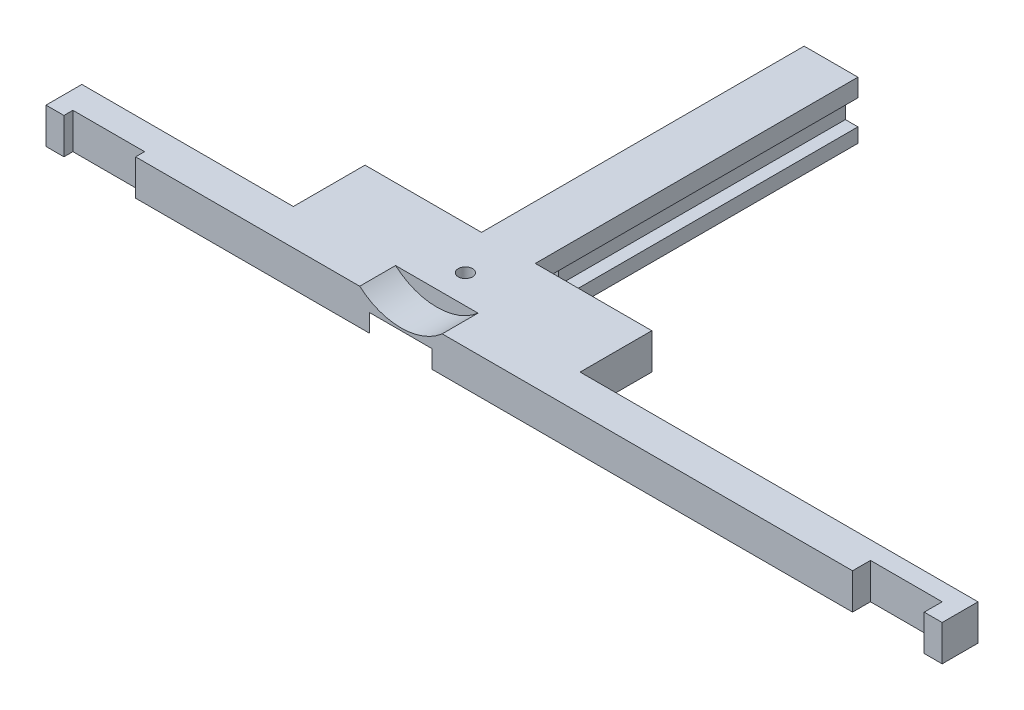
ISO-10303-21;
HEADER;
FILE_DESCRIPTION(('STEP AP214'),'2;1');
FILE_NAME('part.step','',(''),(''),'','','');
FILE_SCHEMA(('AUTOMOTIVE_DESIGN { 1 0 10303 214 1 1 1 1 }'));
ENDSEC;
DATA;
#1=APPLICATION_CONTEXT('core data for automotive mechanical design processes');
#2=APPLICATION_PROTOCOL_DEFINITION('international standard','automotive_design',2000,#1);
#3=PRODUCT_CONTEXT('',#1,'mechanical');
#4=PRODUCT('Part','Part','',(#3));
#5=PRODUCT_RELATED_PRODUCT_CATEGORY('part','',(#4));
#6=PRODUCT_DEFINITION_FORMATION('','',#4);
#7=PRODUCT_DEFINITION_CONTEXT('part definition',#1,'design');
#8=PRODUCT_DEFINITION('design','',#6,#7);
#9=PRODUCT_DEFINITION_SHAPE('','',#8);
#10=(LENGTH_UNIT() NAMED_UNIT(*) SI_UNIT(.MILLI.,.METRE.));
#11=(NAMED_UNIT(*) PLANE_ANGLE_UNIT() SI_UNIT($,.RADIAN.));
#12=(NAMED_UNIT(*) SI_UNIT($,.STERADIAN.) SOLID_ANGLE_UNIT());
#13=UNCERTAINTY_MEASURE_WITH_UNIT(LENGTH_MEASURE(1.E-05),#10,'distance_accuracy_value','');
#14=(GEOMETRIC_REPRESENTATION_CONTEXT(3) GLOBAL_UNCERTAINTY_ASSIGNED_CONTEXT((#13)) GLOBAL_UNIT_ASSIGNED_CONTEXT((#10,
#11,#12)) REPRESENTATION_CONTEXT('',''));
#15=CARTESIAN_POINT('',(0.,0.,0.));
#16=DIRECTION('',(0.,0.,1.));
#17=DIRECTION('',(1.,0.,0.));
#18=AXIS2_PLACEMENT_3D('',#15,#16,#17);
#19=CARTESIAN_POINT('',(-99.,10.,-30.));
#20=DIRECTION('',(0.,0.,1.));
#21=DIRECTION('',(1.,0.,0.));
#22=AXIS2_PLACEMENT_3D('',#19,#20,#21);
#23=PLANE('',#22);
#24=DIRECTION('',(0.,1.,0.));
#25=VECTOR('',#24,1.);
#26=CARTESIAN_POINT('',(-7.49999999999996,10.,-30.));
#27=LINE('',#26,#25);
#28=CARTESIAN_POINT('',(-7.49999999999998,5.,-30.));
#29=VERTEX_POINT('',#28);
#30=CARTESIAN_POINT('',(-7.49999999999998,10.,-30.));
#31=VERTEX_POINT('',#30);
#32=EDGE_CURVE('E341',#29,#31,#27,.T.);
#33=ORIENTED_EDGE('',*,*,#32,.F.);
#34=DIRECTION('',(-1.,0.,0.));
#35=VECTOR('',#34,1.);
#36=CARTESIAN_POINT('',(-99.,5.,-30.));
#37=LINE('',#36,#35);
#38=CARTESIAN_POINT('',(-16.,5.,-30.));
#39=VERTEX_POINT('',#38);
#40=EDGE_CURVE('E425',#29,#39,#37,.T.);
#41=ORIENTED_EDGE('',*,*,#40,.T.);
#42=DIRECTION('',(0.,-1.,0.));
#43=VECTOR('',#42,1.);
#44=CARTESIAN_POINT('',(-16.,5.,-30.));
#45=LINE('',#44,#43);
#46=CARTESIAN_POINT('',(-16.,0.,-30.));
#47=VERTEX_POINT('',#46);
#48=EDGE_CURVE('E422',#47,#39,#45,.F.);
#49=ORIENTED_EDGE('',*,*,#48,.F.);
#50=DIRECTION('',(-1.,0.,0.));
#51=VECTOR('',#50,1.);
#52=CARTESIAN_POINT('',(-99.,0.,-30.));
#53=LINE('',#52,#51);
#54=CARTESIAN_POINT('',(-40.,0.,-30.));
#55=VERTEX_POINT('',#54);
#56=EDGE_CURVE('E464',#47,#55,#53,.T.);
#57=ORIENTED_EDGE('',*,*,#56,.T.);
#58=DIRECTION('',(0.,1.,0.));
#59=VECTOR('',#58,1.);
#60=CARTESIAN_POINT('',(-40.,0.,-30.));
#61=LINE('',#60,#59);
#62=CARTESIAN_POINT('',(-40.,10.,-30.));
#63=VERTEX_POINT('',#62);
#64=EDGE_CURVE('E404',#55,#63,#61,.T.);
#65=ORIENTED_EDGE('',*,*,#64,.T.);
#66=DIRECTION('',(-1.,0.,0.));
#67=VECTOR('',#66,1.);
#68=CARTESIAN_POINT('',(-99.,10.,-30.));
#69=LINE('',#68,#67);
#70=EDGE_CURVE('E436',#31,#63,#69,.T.);
#71=ORIENTED_EDGE('',*,*,#70,.F.);
#72=EDGE_LOOP('',(#33,#41,#49,#57,#65,#71));
#73=FACE_BOUND('',#72,.T.);
#74=ADVANCED_FACE('F37',(#73),#23,.F.);
#75=DIRECTION('',(0.,-1.,0.));
#76=VECTOR('',#75,1.);
#77=CARTESIAN_POINT('',(7.5,10.,-30.));
#78=LINE('',#77,#76);
#79=CARTESIAN_POINT('',(7.50000000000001,10.,-30.));
#80=VERTEX_POINT('',#79);
#81=CARTESIAN_POINT('',(7.5,5.,-30.));
#82=VERTEX_POINT('',#81);
#83=EDGE_CURVE('E344',#80,#82,#78,.T.);
#84=ORIENTED_EDGE('',*,*,#83,.F.);
#85=CARTESIAN_POINT('',(40.,10.,-30.));
#86=VERTEX_POINT('',#85);
#87=EDGE_CURVE('E437',#86,#80,#69,.T.);
#88=ORIENTED_EDGE('',*,*,#87,.F.);
#89=DIRECTION('',(0.,1.,0.));
#90=VECTOR('',#89,1.);
#91=CARTESIAN_POINT('',(40.,0.,-30.));
#92=LINE('',#91,#90);
#93=CARTESIAN_POINT('',(40.,0.,-30.));
#94=VERTEX_POINT('',#93);
#95=EDGE_CURVE('E385',#94,#86,#92,.T.);
#96=ORIENTED_EDGE('',*,*,#95,.F.);
#97=CARTESIAN_POINT('',(16.,0.,-30.));
#98=VERTEX_POINT('',#97);
#99=EDGE_CURVE('E465',#94,#98,#53,.T.);
#100=ORIENTED_EDGE('',*,*,#99,.T.);
#101=DIRECTION('',(0.,-1.,0.));
#102=VECTOR('',#101,1.);
#103=CARTESIAN_POINT('',(16.,5.,-30.));
#104=LINE('',#103,#102);
#105=CARTESIAN_POINT('',(16.,5.,-30.));
#106=VERTEX_POINT('',#105);
#107=EDGE_CURVE('E419',#106,#98,#104,.T.);
#108=ORIENTED_EDGE('',*,*,#107,.F.);
#109=EDGE_CURVE('E426',#106,#82,#37,.T.);
#110=ORIENTED_EDGE('',*,*,#109,.T.);
#111=EDGE_LOOP('',(#84,#88,#96,#100,#108,#110));
#112=FACE_BOUND('',#111,.T.);
#113=ADVANCED_FACE('F582',(#112),#23,.F.);
#114=CARTESIAN_POINT('',(151.,10.,-30.));
#115=DIRECTION('',(-1.,0.,0.));
#116=DIRECTION('',(0.,0.,1.));
#117=AXIS2_PLACEMENT_3D('',#114,#115,#116);
#118=PLANE('',#117);
#119=DIRECTION('',(0.,1.,0.));
#120=VECTOR('',#119,1.);
#121=CARTESIAN_POINT('',(151.,0.,-9.99999999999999));
#122=LINE('',#121,#120);
#123=CARTESIAN_POINT('',(151.,0.,-10.));
#124=VERTEX_POINT('',#123);
#125=CARTESIAN_POINT('',(151.,10.,-9.99999999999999));
#126=VERTEX_POINT('',#125);
#127=EDGE_CURVE('E388',#124,#126,#122,.T.);
#128=ORIENTED_EDGE('',*,*,#127,.T.);
#129=DIRECTION('',(0.,0.,-1.));
#130=VECTOR('',#129,1.);
#131=CARTESIAN_POINT('',(151.,10.,-30.));
#132=LINE('',#131,#130);
#133=CARTESIAN_POINT('',(151.,10.,0.));
#134=VERTEX_POINT('',#133);
#135=EDGE_CURVE('E432',#134,#126,#132,.T.);
#136=ORIENTED_EDGE('',*,*,#135,.F.);
#137=DIRECTION('',(0.,-1.,0.));
#138=VECTOR('',#137,1.);
#139=CARTESIAN_POINT('',(151.,10.,0.));
#140=LINE('',#139,#138);
#141=CARTESIAN_POINT('',(151.,0.,0.));
#142=VERTEX_POINT('',#141);
#143=EDGE_CURVE('E512',#134,#142,#140,.T.);
#144=ORIENTED_EDGE('',*,*,#143,.T.);
#145=DIRECTION('',(0.,0.,-1.));
#146=VECTOR('',#145,1.);
#147=CARTESIAN_POINT('',(151.,0.,-30.));
#148=LINE('',#147,#146);
#149=EDGE_CURVE('E461',#142,#124,#148,.T.);
#150=ORIENTED_EDGE('',*,*,#149,.T.);
#151=EDGE_LOOP('',(#128,#136,#144,#150));
#152=FACE_BOUND('',#151,.T.);
#153=ADVANCED_FACE('F613',(#152),#118,.F.);
#154=CARTESIAN_POINT('',(0.,10.,0.));
#155=DIRECTION('',(0.,-1.,0.));
#156=DIRECTION('',(0.,0.,-1.));
#157=AXIS2_PLACEMENT_3D('',#154,#155,#156);
#158=PLANE('',#157);
#159=CARTESIAN_POINT('',(0.,10.,-18.));
#160=DIRECTION('',(0.,-1.,0.));
#161=DIRECTION('',(0.,0.,-1.));
#162=AXIS2_PLACEMENT_3D('',#159,#160,#161);
#163=CIRCLE('',#162,2.);
#164=CARTESIAN_POINT('',(0.,10.,-20.));
#165=VERTEX_POINT('',#164);
#166=EDGE_CURVE('E660',#165,#165,#163,.T.);
#167=ORIENTED_EDGE('',*,*,#166,.T.);
#168=EDGE_LOOP('',(#167));
#169=FACE_BOUND('',#168,.T.);
#170=DIRECTION('',(-1.,0.,0.));
#171=VECTOR('',#170,1.);
#172=CARTESIAN_POINT('',(0.,10.,-10.));
#173=LINE('',#172,#171);
#174=CARTESIAN_POINT('',(11.522818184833,10.,-10.));
#175=VERTEX_POINT('',#174);
#176=CARTESIAN_POINT('',(-11.4843424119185,10.,-10.));
#177=VERTEX_POINT('',#176);
#178=EDGE_CURVE('E11',#175,#177,#173,.T.);
#179=ORIENTED_EDGE('',*,*,#178,.F.);
#180=DIRECTION('',(0.,0.,1.));
#181=VECTOR('',#180,1.);
#182=CARTESIAN_POINT('',(11.522818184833,10.,-10.));
#183=LINE('',#182,#181);
#184=CARTESIAN_POINT('',(11.522818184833,10.,0.));
#185=VERTEX_POINT('',#184);
#186=EDGE_CURVE('E264',#175,#185,#183,.T.);
#187=ORIENTED_EDGE('',*,*,#186,.T.);
#188=DIRECTION('',(1.,0.,0.));
#189=VECTOR('',#188,1.);
#190=CARTESIAN_POINT('',(-74.,10.,0.));
#191=LINE('',#190,#189);
#192=CARTESIAN_POINT('',(126.,10.,0.));
#193=VERTEX_POINT('',#192);
#194=EDGE_CURVE('E450',#185,#193,#191,.T.);
#195=ORIENTED_EDGE('',*,*,#194,.T.);
#196=DIRECTION('',(0.,0.,-1.));
#197=VECTOR('',#196,1.);
#198=CARTESIAN_POINT('',(126.,10.,-5.));
#199=LINE('',#198,#197);
#200=CARTESIAN_POINT('',(126.,10.,-5.));
#201=VERTEX_POINT('',#200);
#202=EDGE_CURVE('E452',#193,#201,#199,.T.);
#203=ORIENTED_EDGE('',*,*,#202,.T.);
#204=DIRECTION('',(1.,0.,0.));
#205=VECTOR('',#204,1.);
#206=CARTESIAN_POINT('',(146.,10.,-5.));
#207=LINE('',#206,#205);
#208=CARTESIAN_POINT('',(146.,10.,-5.));
#209=VERTEX_POINT('',#208);
#210=EDGE_CURVE('E454',#201,#209,#207,.T.);
#211=ORIENTED_EDGE('',*,*,#210,.T.);
#212=DIRECTION('',(0.,0.,1.));
#213=VECTOR('',#212,1.);
#214=CARTESIAN_POINT('',(146.,10.,0.));
#215=LINE('',#214,#213);
#216=CARTESIAN_POINT('',(146.,10.,0.));
#217=VERTEX_POINT('',#216);
#218=EDGE_CURVE('E456',#209,#217,#215,.T.);
#219=ORIENTED_EDGE('',*,*,#218,.T.);
#220=DIRECTION('',(1.,0.,0.));
#221=VECTOR('',#220,1.);
#222=CARTESIAN_POINT('',(146.,10.,0.));
#223=LINE('',#222,#221);
#224=EDGE_CURVE('E429',#217,#134,#223,.T.);
#225=ORIENTED_EDGE('',*,*,#224,.T.);
#226=ORIENTED_EDGE('',*,*,#135,.T.);
#227=DIRECTION('',(-1.,0.,0.));
#228=VECTOR('',#227,1.);
#229=CARTESIAN_POINT('',(0.,10.,-9.99999999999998));
#230=LINE('',#229,#228);
#231=CARTESIAN_POINT('',(40.,10.,-9.99999999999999));
#232=VERTEX_POINT('',#231);
#233=EDGE_CURVE('E376',#126,#232,#230,.T.);
#234=ORIENTED_EDGE('',*,*,#233,.T.);
#235=DIRECTION('',(0.,0.,-1.));
#236=VECTOR('',#235,1.);
#237=CARTESIAN_POINT('',(40.,10.,0.));
#238=LINE('',#237,#236);
#239=EDGE_CURVE('E379',#232,#86,#238,.T.);
#240=ORIENTED_EDGE('',*,*,#239,.T.);
#241=ORIENTED_EDGE('',*,*,#87,.T.);
#242=DIRECTION('',(0.,0.,1.));
#243=VECTOR('',#242,1.);
#244=CARTESIAN_POINT('',(7.5,10.,-40.));
#245=LINE('',#244,#243);
#246=CARTESIAN_POINT('',(7.5,10.,-120.));
#247=VERTEX_POINT('',#246);
#248=EDGE_CURVE('E354',#247,#80,#245,.T.);
#249=ORIENTED_EDGE('',*,*,#248,.F.);
#250=DIRECTION('',(1.,0.,0.));
#251=VECTOR('',#250,1.);
#252=CARTESIAN_POINT('',(7.5,10.,-120.));
#253=LINE('',#252,#251);
#254=CARTESIAN_POINT('',(-7.49999999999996,10.,-120.));
#255=VERTEX_POINT('',#254);
#256=EDGE_CURVE('E302',#255,#247,#253,.T.);
#257=ORIENTED_EDGE('',*,*,#256,.F.);
#258=DIRECTION('',(0.,0.,1.));
#259=VECTOR('',#258,1.);
#260=CARTESIAN_POINT('',(-7.49999999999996,10.,-40.));
#261=LINE('',#260,#259);
#262=EDGE_CURVE('E357',#255,#31,#261,.T.);
#263=ORIENTED_EDGE('',*,*,#262,.T.);
#264=ORIENTED_EDGE('',*,*,#70,.T.);
#265=DIRECTION('',(0.,0.,-1.));
#266=VECTOR('',#265,1.);
#267=CARTESIAN_POINT('',(-40.,10.,0.));
#268=LINE('',#267,#266);
#269=CARTESIAN_POINT('',(-40.,10.,-10.));
#270=VERTEX_POINT('',#269);
#271=EDGE_CURVE('E396',#270,#63,#268,.T.);
#272=ORIENTED_EDGE('',*,*,#271,.F.);
#273=DIRECTION('',(1.,0.,0.));
#274=VECTOR('',#273,1.);
#275=CARTESIAN_POINT('',(0.,10.,-10.));
#276=LINE('',#275,#274);
#277=CARTESIAN_POINT('',(-99.,10.,-10.));
#278=VERTEX_POINT('',#277);
#279=EDGE_CURVE('E370',#278,#270,#276,.T.);
#280=ORIENTED_EDGE('',*,*,#279,.F.);
#281=DIRECTION('',(0.,0.,1.));
#282=VECTOR('',#281,1.);
#283=CARTESIAN_POINT('',(-99.,10.,-30.));
#284=LINE('',#283,#282);
#285=CARTESIAN_POINT('',(-99.,10.,0.));
#286=VERTEX_POINT('',#285);
#287=EDGE_CURVE('E440',#278,#286,#284,.T.);
#288=ORIENTED_EDGE('',*,*,#287,.T.);
#289=DIRECTION('',(1.,0.,0.));
#290=VECTOR('',#289,1.);
#291=CARTESIAN_POINT('',(-99.,10.,0.));
#292=LINE('',#291,#290);
#293=CARTESIAN_POINT('',(-94.,10.,0.));
#294=VERTEX_POINT('',#293);
#295=EDGE_CURVE('E442',#286,#294,#292,.T.);
#296=ORIENTED_EDGE('',*,*,#295,.T.);
#297=DIRECTION('',(0.,0.,-1.));
#298=VECTOR('',#297,1.);
#299=CARTESIAN_POINT('',(-94.,10.,-2.49999999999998));
#300=LINE('',#299,#298);
#301=CARTESIAN_POINT('',(-94.,10.,-2.49999999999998));
#302=VERTEX_POINT('',#301);
#303=EDGE_CURVE('E444',#294,#302,#300,.T.);
#304=ORIENTED_EDGE('',*,*,#303,.T.);
#305=DIRECTION('',(1.,0.,0.));
#306=VECTOR('',#305,1.);
#307=CARTESIAN_POINT('',(-74.,10.,-2.49999999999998));
#308=LINE('',#307,#306);
#309=CARTESIAN_POINT('',(-74.,10.,-2.49999999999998));
#310=VERTEX_POINT('',#309);
#311=EDGE_CURVE('E446',#302,#310,#308,.T.);
#312=ORIENTED_EDGE('',*,*,#311,.T.);
#313=DIRECTION('',(0.,0.,1.));
#314=VECTOR('',#313,1.);
#315=CARTESIAN_POINT('',(-74.,10.,-2.49999999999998));
#316=LINE('',#315,#314);
#317=CARTESIAN_POINT('',(-74.,10.,0.));
#318=VERTEX_POINT('',#317);
#319=EDGE_CURVE('E448',#310,#318,#316,.T.);
#320=ORIENTED_EDGE('',*,*,#319,.T.);
#321=CARTESIAN_POINT('',(-11.4843424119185,10.,0.));
#322=VERTEX_POINT('',#321);
#323=EDGE_CURVE('E270',#318,#322,#191,.T.);
#324=ORIENTED_EDGE('',*,*,#323,.T.);
#325=DIRECTION('',(0.,0.,1.));
#326=VECTOR('',#325,1.);
#327=CARTESIAN_POINT('',(-11.4843424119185,10.,-10.));
#328=LINE('',#327,#326);
#329=EDGE_CURVE('E52',#322,#177,#328,.F.);
#330=ORIENTED_EDGE('',*,*,#329,.T.);
#331=EDGE_LOOP('',(#179,#187,#195,#203,#211,#219,#225,#226,#234,#240,#241,#249,#257,#263,#264,
#272,#280,#288,#296,#304,#312,#320,#324,#330));
#332=FACE_BOUND('',#331,.T.);
#333=ADVANCED_FACE('F268',(#169,#332),#158,.F.);
#334=CARTESIAN_POINT('',(0.,0.,0.));
#335=DIRECTION('',(0.,-1.,0.));
#336=DIRECTION('',(0.,0.,-1.));
#337=AXIS2_PLACEMENT_3D('',#334,#335,#336);
#338=PLANE('',#337);
#339=CARTESIAN_POINT('',(30.,0.,-18.));
#340=DIRECTION('',(0.,-1.,0.));
#341=DIRECTION('',(0.,0.,1.));
#342=AXIS2_PLACEMENT_3D('',#339,#340,#341);
#343=CIRCLE('',#342,2.);
#344=CARTESIAN_POINT('',(30.,0.,-16.));
#345=VERTEX_POINT('',#344);
#346=EDGE_CURVE('E360',#345,#345,#343,.T.);
#347=ORIENTED_EDGE('',*,*,#346,.F.);
#348=EDGE_LOOP('',(#347));
#349=FACE_BOUND('',#348,.T.);
#350=ORIENTED_EDGE('',*,*,#99,.F.);
#351=DIRECTION('',(0.,0.,-1.));
#352=VECTOR('',#351,1.);
#353=CARTESIAN_POINT('',(40.,0.,0.));
#354=LINE('',#353,#352);
#355=CARTESIAN_POINT('',(40.,0.,-9.99999999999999));
#356=VERTEX_POINT('',#355);
#357=EDGE_CURVE('E373',#356,#94,#354,.T.);
#358=ORIENTED_EDGE('',*,*,#357,.F.);
#359=DIRECTION('',(-1.,0.,0.));
#360=VECTOR('',#359,1.);
#361=CARTESIAN_POINT('',(0.,0.,-9.99999999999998));
#362=LINE('',#361,#360);
#363=EDGE_CURVE('E375',#124,#356,#362,.T.);
#364=ORIENTED_EDGE('',*,*,#363,.F.);
#365=ORIENTED_EDGE('',*,*,#149,.F.);
#366=DIRECTION('',(1.,0.,0.));
#367=VECTOR('',#366,1.);
#368=CARTESIAN_POINT('',(146.,0.,0.));
#369=LINE('',#368,#367);
#370=CARTESIAN_POINT('',(146.,0.,0.));
#371=VERTEX_POINT('',#370);
#372=EDGE_CURVE('E428',#371,#142,#369,.T.);
#373=ORIENTED_EDGE('',*,*,#372,.F.);
#374=DIRECTION('',(0.,0.,1.));
#375=VECTOR('',#374,1.);
#376=CARTESIAN_POINT('',(146.,0.,0.));
#377=LINE('',#376,#375);
#378=CARTESIAN_POINT('',(146.,0.,-5.));
#379=VERTEX_POINT('',#378);
#380=EDGE_CURVE('E433',#379,#371,#377,.T.);
#381=ORIENTED_EDGE('',*,*,#380,.F.);
#382=DIRECTION('',(1.,0.,0.));
#383=VECTOR('',#382,1.);
#384=CARTESIAN_POINT('',(146.,0.,-5.));
#385=LINE('',#384,#383);
#386=CARTESIAN_POINT('',(126.,0.,-5.));
#387=VERTEX_POINT('',#386);
#388=EDGE_CURVE('E483',#387,#379,#385,.T.);
#389=ORIENTED_EDGE('',*,*,#388,.F.);
#390=DIRECTION('',(0.,0.,-1.));
#391=VECTOR('',#390,1.);
#392=CARTESIAN_POINT('',(126.,0.,-5.));
#393=LINE('',#392,#391);
#394=CARTESIAN_POINT('',(126.,0.,0.));
#395=VERTEX_POINT('',#394);
#396=EDGE_CURVE('E481',#395,#387,#393,.T.);
#397=ORIENTED_EDGE('',*,*,#396,.F.);
#398=DIRECTION('',(1.,0.,0.));
#399=VECTOR('',#398,1.);
#400=CARTESIAN_POINT('',(-74.,0.,0.));
#401=LINE('',#400,#399);
#402=CARTESIAN_POINT('',(8.71779788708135,0.,0.));
#403=VERTEX_POINT('',#402);
#404=EDGE_CURVE('E477',#403,#395,#401,.T.);
#405=ORIENTED_EDGE('',*,*,#404,.F.);
#406=CARTESIAN_POINT('',(0.,0.,-18.));
#407=DIRECTION('',(0.,1.,0.));
#408=DIRECTION('',(0.,0.,1.));
#409=AXIS2_PLACEMENT_3D('',#406,#407,#408);
#410=CIRCLE('',#409,20.);
#411=EDGE_CURVE('E387',#403,#98,#410,.T.);
#412=ORIENTED_EDGE('',*,*,#411,.T.);
#413=EDGE_LOOP('',(#350,#358,#364,#365,#373,#381,#389,#397,#405,#412));
#414=FACE_BOUND('',#413,.T.);
#415=ADVANCED_FACE('F592',(#349,#414),#338,.T.);
#416=CARTESIAN_POINT('',(-74.,10.,0.));
#417=DIRECTION('',(0.,0.,-1.));
#418=DIRECTION('',(-1.,0.,0.));
#419=AXIS2_PLACEMENT_3D('',#416,#417,#418);
#420=PLANE('',#419);
#421=ORIENTED_EDGE('',*,*,#194,.F.);
#422=CARTESIAN_POINT('',(0.019237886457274,23.1877837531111,0.));
#423=DIRECTION('',(0.,0.,1.));
#424=DIRECTION('',(1.,0.,0.));
#425=AXIS2_PLACEMENT_3D('',#422,#423,#424);
#426=CIRCLE('',#425,17.5);
#427=EDGE_CURVE('E265',#322,#185,#426,.T.);
#428=ORIENTED_EDGE('',*,*,#427,.F.);
#429=ORIENTED_EDGE('',*,*,#323,.F.);
#430=DIRECTION('',(0.,-1.,0.));
#431=VECTOR('',#430,1.);
#432=CARTESIAN_POINT('',(-74.,10.,0.));
#433=LINE('',#432,#431);
#434=CARTESIAN_POINT('',(-74.,0.,0.));
#435=VERTEX_POINT('',#434);
#436=EDGE_CURVE('E497',#318,#435,#433,.T.);
#437=ORIENTED_EDGE('',*,*,#436,.T.);
#438=CARTESIAN_POINT('',(-8.71779788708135,0.,0.));
#439=VERTEX_POINT('',#438);
#440=EDGE_CURVE('E478',#435,#439,#401,.T.);
#441=ORIENTED_EDGE('',*,*,#440,.T.);
#442=DIRECTION('',(0.,-1.,0.));
#443=VECTOR('',#442,1.);
#444=CARTESIAN_POINT('',(-8.71779788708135,5.,0.));
#445=LINE('',#444,#443);
#446=CARTESIAN_POINT('',(-8.71779788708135,5.,0.));
#447=VERTEX_POINT('',#446);
#448=EDGE_CURVE('E412',#447,#439,#445,.T.);
#449=ORIENTED_EDGE('',*,*,#448,.F.);
#450=DIRECTION('',(1.,0.,0.));
#451=VECTOR('',#450,1.);
#452=CARTESIAN_POINT('',(-74.,5.,0.));
#453=LINE('',#452,#451);
#454=CARTESIAN_POINT('',(8.71779788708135,5.,0.));
#455=VERTEX_POINT('',#454);
#456=EDGE_CURVE('E45',#447,#455,#453,.T.);
#457=ORIENTED_EDGE('',*,*,#456,.T.);
#458=DIRECTION('',(0.,-1.,0.));
#459=VECTOR('',#458,1.);
#460=CARTESIAN_POINT('',(8.71779788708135,5.,0.));
#461=LINE('',#460,#459);
#462=EDGE_CURVE('E417',#403,#455,#461,.F.);
#463=ORIENTED_EDGE('',*,*,#462,.F.);
#464=ORIENTED_EDGE('',*,*,#404,.T.);
#465=DIRECTION('',(0.,-1.,0.));
#466=VECTOR('',#465,1.);
#467=CARTESIAN_POINT('',(126.,10.,0.));
#468=LINE('',#467,#466);
#469=EDGE_CURVE('E494',#193,#395,#468,.T.);
#470=ORIENTED_EDGE('',*,*,#469,.F.);
#471=EDGE_LOOP('',(#421,#428,#429,#437,#441,#449,#457,#463,#464,#470));
#472=FACE_BOUND('',#471,.T.);
#473=ADVANCED_FACE('F522',(#472),#420,.F.);
#474=CARTESIAN_POINT('',(-30.,0.,-18.));
#475=DIRECTION('',(0.,-1.,0.));
#476=DIRECTION('',(0.,0.,-1.));
#477=AXIS2_PLACEMENT_3D('',#474,#475,#476);
#478=CIRCLE('',#477,2.);
#479=CARTESIAN_POINT('',(-30.,0.,-20.));
#480=VERTEX_POINT('',#479);
#481=EDGE_CURVE('E364',#480,#480,#478,.T.);
#482=ORIENTED_EDGE('',*,*,#481,.F.);
#483=EDGE_LOOP('',(#482));
#484=FACE_BOUND('',#483,.T.);
#485=DIRECTION('',(1.,0.,0.));
#486=VECTOR('',#485,1.);
#487=CARTESIAN_POINT('',(0.,0.,-10.));
#488=LINE('',#487,#486);
#489=CARTESIAN_POINT('',(-99.,0.,-10.));
#490=VERTEX_POINT('',#489);
#491=CARTESIAN_POINT('',(-40.,0.,-10.));
#492=VERTEX_POINT('',#491);
#493=EDGE_CURVE('E392',#490,#492,#488,.T.);
#494=ORIENTED_EDGE('',*,*,#493,.T.);
#495=DIRECTION('',(0.,0.,-1.));
#496=VECTOR('',#495,1.);
#497=CARTESIAN_POINT('',(-40.,0.,0.));
#498=LINE('',#497,#496);
#499=EDGE_CURVE('E395',#492,#55,#498,.T.);
#500=ORIENTED_EDGE('',*,*,#499,.T.);
#501=ORIENTED_EDGE('',*,*,#56,.F.);
#502=CARTESIAN_POINT('',(0.,0.,-18.));
#503=DIRECTION('',(0.,-1.,0.));
#504=DIRECTION('',(0.,0.,-1.));
#505=AXIS2_PLACEMENT_3D('',#502,#503,#504);
#506=CIRCLE('',#505,20.);
#507=EDGE_CURVE('E515',#47,#439,#506,.F.);
#508=ORIENTED_EDGE('',*,*,#507,.T.);
#509=ORIENTED_EDGE('',*,*,#440,.F.);
#510=DIRECTION('',(0.,0.,1.));
#511=VECTOR('',#510,1.);
#512=CARTESIAN_POINT('',(-74.,0.,-2.49999999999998));
#513=LINE('',#512,#511);
#514=CARTESIAN_POINT('',(-74.,0.,-2.49999999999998));
#515=VERTEX_POINT('',#514);
#516=EDGE_CURVE('E475',#515,#435,#513,.T.);
#517=ORIENTED_EDGE('',*,*,#516,.F.);
#518=DIRECTION('',(1.,0.,0.));
#519=VECTOR('',#518,1.);
#520=CARTESIAN_POINT('',(-74.,0.,-2.49999999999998));
#521=LINE('',#520,#519);
#522=CARTESIAN_POINT('',(-94.,0.,-2.49999999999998));
#523=VERTEX_POINT('',#522);
#524=EDGE_CURVE('E473',#523,#515,#521,.T.);
#525=ORIENTED_EDGE('',*,*,#524,.F.);
#526=DIRECTION('',(0.,0.,-1.));
#527=VECTOR('',#526,1.);
#528=CARTESIAN_POINT('',(-94.,0.,-2.49999999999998));
#529=LINE('',#528,#527);
#530=CARTESIAN_POINT('',(-94.,0.,0.));
#531=VERTEX_POINT('',#530);
#532=EDGE_CURVE('E471',#531,#523,#529,.T.);
#533=ORIENTED_EDGE('',*,*,#532,.F.);
#534=DIRECTION('',(1.,0.,0.));
#535=VECTOR('',#534,1.);
#536=CARTESIAN_POINT('',(-99.,0.,0.));
#537=LINE('',#536,#535);
#538=CARTESIAN_POINT('',(-99.,0.,0.));
#539=VERTEX_POINT('',#538);
#540=EDGE_CURVE('E469',#539,#531,#537,.T.);
#541=ORIENTED_EDGE('',*,*,#540,.F.);
#542=DIRECTION('',(0.,0.,1.));
#543=VECTOR('',#542,1.);
#544=CARTESIAN_POINT('',(-99.,0.,-30.));
#545=LINE('',#544,#543);
#546=EDGE_CURVE('E467',#490,#539,#545,.T.);
#547=ORIENTED_EDGE('',*,*,#546,.F.);
#548=EDGE_LOOP('',(#494,#500,#501,#508,#509,#517,#525,#533,#541,#547));
#549=FACE_BOUND('',#548,.T.);
#550=ADVANCED_FACE('F537',(#484,#549),#338,.T.);
#551=CARTESIAN_POINT('',(146.,10.,0.));
#552=DIRECTION('',(0.,0.,-1.));
#553=DIRECTION('',(-1.,0.,0.));
#554=AXIS2_PLACEMENT_3D('',#551,#552,#553);
#555=PLANE('',#554);
#556=ORIENTED_EDGE('',*,*,#372,.T.);
#557=ORIENTED_EDGE('',*,*,#143,.F.);
#558=ORIENTED_EDGE('',*,*,#224,.F.);
#559=DIRECTION('',(0.,-1.,0.));
#560=VECTOR('',#559,1.);
#561=CARTESIAN_POINT('',(146.,10.,0.));
#562=LINE('',#561,#560);
#563=EDGE_CURVE('E458',#217,#371,#562,.T.);
#564=ORIENTED_EDGE('',*,*,#563,.T.);
#565=EDGE_LOOP('',(#556,#557,#558,#564));
#566=FACE_BOUND('',#565,.T.);
#567=ADVANCED_FACE('F39',(#566),#555,.F.);
#568=CARTESIAN_POINT('',(-99.,10.,-30.));
#569=DIRECTION('',(1.,0.,0.));
#570=DIRECTION('',(0.,0.,-1.));
#571=AXIS2_PLACEMENT_3D('',#568,#569,#570);
#572=PLANE('',#571);
#573=ORIENTED_EDGE('',*,*,#287,.F.);
#574=DIRECTION('',(0.,1.,0.));
#575=VECTOR('',#574,1.);
#576=CARTESIAN_POINT('',(-99.,0.,-10.));
#577=LINE('',#576,#575);
#578=EDGE_CURVE('E382',#490,#278,#577,.T.);
#579=ORIENTED_EDGE('',*,*,#578,.F.);
#580=ORIENTED_EDGE('',*,*,#546,.T.);
#581=DIRECTION('',(0.,-1.,0.));
#582=VECTOR('',#581,1.);
#583=CARTESIAN_POINT('',(-99.,10.,0.));
#584=LINE('',#583,#582);
#585=EDGE_CURVE('E509',#286,#539,#584,.T.);
#586=ORIENTED_EDGE('',*,*,#585,.F.);
#587=EDGE_LOOP('',(#573,#579,#580,#586));
#588=FACE_BOUND('',#587,.T.);
#589=ADVANCED_FACE('F615',(#588),#572,.F.);
#590=CARTESIAN_POINT('',(-99.,10.,0.));
#591=DIRECTION('',(0.,0.,-1.));
#592=DIRECTION('',(-1.,0.,0.));
#593=AXIS2_PLACEMENT_3D('',#590,#591,#592);
#594=PLANE('',#593);
#595=ORIENTED_EDGE('',*,*,#540,.T.);
#596=DIRECTION('',(0.,-1.,0.));
#597=VECTOR('',#596,1.);
#598=CARTESIAN_POINT('',(-94.,10.,0.));
#599=LINE('',#598,#597);
#600=EDGE_CURVE('E506',#294,#531,#599,.T.);
#601=ORIENTED_EDGE('',*,*,#600,.F.);
#602=ORIENTED_EDGE('',*,*,#295,.F.);
#603=ORIENTED_EDGE('',*,*,#585,.T.);
#604=EDGE_LOOP('',(#595,#601,#602,#603));
#605=FACE_BOUND('',#604,.T.);
#606=ADVANCED_FACE('F693',(#605),#594,.F.);
#607=CARTESIAN_POINT('',(-94.,10.,-2.49999999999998));
#608=DIRECTION('',(-1.,0.,0.));
#609=DIRECTION('',(0.,0.,1.));
#610=AXIS2_PLACEMENT_3D('',#607,#608,#609);
#611=PLANE('',#610);
#612=ORIENTED_EDGE('',*,*,#532,.T.);
#613=DIRECTION('',(0.,-1.,0.));
#614=VECTOR('',#613,1.);
#615=CARTESIAN_POINT('',(-94.,10.,-2.49999999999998));
#616=LINE('',#615,#614);
#617=EDGE_CURVE('E503',#302,#523,#616,.T.);
#618=ORIENTED_EDGE('',*,*,#617,.F.);
#619=ORIENTED_EDGE('',*,*,#303,.F.);
#620=ORIENTED_EDGE('',*,*,#600,.T.);
#621=EDGE_LOOP('',(#612,#618,#619,#620));
#622=FACE_BOUND('',#621,.T.);
#623=ADVANCED_FACE('F690',(#622),#611,.F.);
#624=CARTESIAN_POINT('',(-74.,10.,-2.49999999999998));
#625=DIRECTION('',(0.,0.,-1.));
#626=DIRECTION('',(-1.,0.,0.));
#627=AXIS2_PLACEMENT_3D('',#624,#625,#626);
#628=PLANE('',#627);
#629=ORIENTED_EDGE('',*,*,#524,.T.);
#630=DIRECTION('',(0.,-1.,0.));
#631=VECTOR('',#630,1.);
#632=CARTESIAN_POINT('',(-74.,10.,-2.49999999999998));
#633=LINE('',#632,#631);
#634=EDGE_CURVE('E500',#310,#515,#633,.T.);
#635=ORIENTED_EDGE('',*,*,#634,.F.);
#636=ORIENTED_EDGE('',*,*,#311,.F.);
#637=ORIENTED_EDGE('',*,*,#617,.T.);
#638=EDGE_LOOP('',(#629,#635,#636,#637));
#639=FACE_BOUND('',#638,.T.);
#640=ADVANCED_FACE('F686',(#639),#628,.F.);
#641=CARTESIAN_POINT('',(-74.,10.,-2.49999999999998));
#642=DIRECTION('',(1.,0.,0.));
#643=DIRECTION('',(0.,0.,-1.));
#644=AXIS2_PLACEMENT_3D('',#641,#642,#643);
#645=PLANE('',#644);
#646=ORIENTED_EDGE('',*,*,#516,.T.);
#647=ORIENTED_EDGE('',*,*,#436,.F.);
#648=ORIENTED_EDGE('',*,*,#319,.F.);
#649=ORIENTED_EDGE('',*,*,#634,.T.);
#650=EDGE_LOOP('',(#646,#647,#648,#649));
#651=FACE_BOUND('',#650,.T.);
#652=ADVANCED_FACE('F678',(#651),#645,.F.);
#653=CARTESIAN_POINT('',(126.,10.,-5.));
#654=DIRECTION('',(-1.,0.,0.));
#655=DIRECTION('',(0.,0.,1.));
#656=AXIS2_PLACEMENT_3D('',#653,#654,#655);
#657=PLANE('',#656);
#658=ORIENTED_EDGE('',*,*,#396,.T.);
#659=DIRECTION('',(0.,-1.,0.));
#660=VECTOR('',#659,1.);
#661=CARTESIAN_POINT('',(126.,10.,-5.));
#662=LINE('',#661,#660);
#663=EDGE_CURVE('E491',#201,#387,#662,.T.);
#664=ORIENTED_EDGE('',*,*,#663,.F.);
#665=ORIENTED_EDGE('',*,*,#202,.F.);
#666=ORIENTED_EDGE('',*,*,#469,.T.);
#667=EDGE_LOOP('',(#658,#664,#665,#666));
#668=FACE_BOUND('',#667,.T.);
#669=ADVANCED_FACE('F669',(#668),#657,.F.);
#670=CARTESIAN_POINT('',(146.,10.,-5.));
#671=DIRECTION('',(0.,0.,-1.));
#672=DIRECTION('',(-1.,0.,0.));
#673=AXIS2_PLACEMENT_3D('',#670,#671,#672);
#674=PLANE('',#673);
#675=ORIENTED_EDGE('',*,*,#388,.T.);
#676=DIRECTION('',(0.,-1.,0.));
#677=VECTOR('',#676,1.);
#678=CARTESIAN_POINT('',(146.,10.,-5.));
#679=LINE('',#678,#677);
#680=EDGE_CURVE('E488',#209,#379,#679,.T.);
#681=ORIENTED_EDGE('',*,*,#680,.F.);
#682=ORIENTED_EDGE('',*,*,#210,.F.);
#683=ORIENTED_EDGE('',*,*,#663,.T.);
#684=EDGE_LOOP('',(#675,#681,#682,#683));
#685=FACE_BOUND('',#684,.T.);
#686=ADVANCED_FACE('F653',(#685),#674,.F.);
#687=CARTESIAN_POINT('',(146.,10.,0.));
#688=DIRECTION('',(1.,0.,0.));
#689=DIRECTION('',(0.,0.,-1.));
#690=AXIS2_PLACEMENT_3D('',#687,#688,#689);
#691=PLANE('',#690);
#692=ORIENTED_EDGE('',*,*,#380,.T.);
#693=ORIENTED_EDGE('',*,*,#563,.F.);
#694=ORIENTED_EDGE('',*,*,#218,.F.);
#695=ORIENTED_EDGE('',*,*,#680,.T.);
#696=EDGE_LOOP('',(#692,#693,#694,#695));
#697=FACE_BOUND('',#696,.T.);
#698=ADVANCED_FACE('F647',(#697),#691,.F.);
#699=CARTESIAN_POINT('',(0.,5.,-18.));
#700=DIRECTION('',(0.,1.,0.));
#701=DIRECTION('',(0.,0.,1.));
#702=AXIS2_PLACEMENT_3D('',#699,#700,#701);
#703=PLANE('',#702);
#704=CARTESIAN_POINT('',(0.,5.,-18.));
#705=DIRECTION('',(0.,-1.,0.));
#706=DIRECTION('',(0.,0.,-1.));
#707=AXIS2_PLACEMENT_3D('',#704,#705,#706);
#708=CIRCLE('',#707,2.);
#709=CARTESIAN_POINT('',(0.,5.,-20.));
#710=VERTEX_POINT('',#709);
#711=EDGE_CURVE('E658',#710,#710,#708,.T.);
#712=ORIENTED_EDGE('',*,*,#711,.F.);
#713=EDGE_LOOP('',(#712));
#714=FACE_BOUND('',#713,.T.);
#715=CARTESIAN_POINT('',(0.,5.,-18.));
#716=DIRECTION('',(0.,1.,0.));
#717=DIRECTION('',(0.,0.,1.));
#718=AXIS2_PLACEMENT_3D('',#715,#716,#717);
#719=CIRCLE('',#718,20.);
#720=EDGE_CURVE('E409',#455,#106,#719,.T.);
#721=ORIENTED_EDGE('',*,*,#720,.F.);
#722=ORIENTED_EDGE('',*,*,#456,.F.);
#723=EDGE_CURVE('E413',#39,#447,#719,.T.);
#724=ORIENTED_EDGE('',*,*,#723,.F.);
#725=ORIENTED_EDGE('',*,*,#40,.F.);
#726=DIRECTION('',(0.,0.,1.));
#727=VECTOR('',#726,1.);
#728=CARTESIAN_POINT('',(-7.49999999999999,5.00000000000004,-40.));
#729=LINE('',#728,#727);
#730=CARTESIAN_POINT('',(-7.49999999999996,5.,-120.));
#731=VERTEX_POINT('',#730);
#732=EDGE_CURVE('E343',#731,#29,#729,.T.);
#733=ORIENTED_EDGE('',*,*,#732,.F.);
#734=DIRECTION('',(-1.,0.,0.));
#735=VECTOR('',#734,1.);
#736=CARTESIAN_POINT('',(-7.49999999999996,5.,-120.));
#737=LINE('',#736,#735);
#738=CARTESIAN_POINT('',(-3.99999999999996,5.,-120.));
#739=VERTEX_POINT('',#738);
#740=EDGE_CURVE('E296',#739,#731,#737,.T.);
#741=ORIENTED_EDGE('',*,*,#740,.F.);
#742=DIRECTION('',(0.,0.,1.));
#743=VECTOR('',#742,1.);
#744=CARTESIAN_POINT('',(-3.99999999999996,5.,-120.));
#745=LINE('',#744,#743);
#746=CARTESIAN_POINT('',(-3.99999999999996,5.00000000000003,-40.));
#747=VERTEX_POINT('',#746);
#748=EDGE_CURVE('E305',#739,#747,#745,.T.);
#749=ORIENTED_EDGE('',*,*,#748,.T.);
#750=DIRECTION('',(-1.,0.,0.));
#751=VECTOR('',#750,1.);
#752=CARTESIAN_POINT('',(7.5,5.,-40.));
#753=LINE('',#752,#751);
#754=CARTESIAN_POINT('',(4.,5.00000000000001,-40.));
#755=VERTEX_POINT('',#754);
#756=EDGE_CURVE('E60',#755,#747,#753,.T.);
#757=ORIENTED_EDGE('',*,*,#756,.F.);
#758=DIRECTION('',(0.,0.,1.));
#759=VECTOR('',#758,1.);
#760=CARTESIAN_POINT('',(4.,5.,-120.));
#761=LINE('',#760,#759);
#762=CARTESIAN_POINT('',(4.,5.,-120.));
#763=VERTEX_POINT('',#762);
#764=EDGE_CURVE('E338',#763,#755,#761,.T.);
#765=ORIENTED_EDGE('',*,*,#764,.F.);
#766=DIRECTION('',(-1.,0.,0.));
#767=VECTOR('',#766,1.);
#768=CARTESIAN_POINT('',(7.5,5.,-120.));
#769=LINE('',#768,#767);
#770=CARTESIAN_POINT('',(7.5,5.,-120.));
#771=VERTEX_POINT('',#770);
#772=EDGE_CURVE('E279',#771,#763,#769,.T.);
#773=ORIENTED_EDGE('',*,*,#772,.F.);
#774=DIRECTION('',(0.,0.,1.));
#775=VECTOR('',#774,1.);
#776=CARTESIAN_POINT('',(7.5,5.,-40.));
#777=LINE('',#776,#775);
#778=EDGE_CURVE('E351',#771,#82,#777,.T.);
#779=ORIENTED_EDGE('',*,*,#778,.T.);
#780=ORIENTED_EDGE('',*,*,#109,.F.);
#781=EDGE_LOOP('',(#721,#722,#724,#725,#733,#741,#749,#757,#765,#773,#779,#780));
#782=FACE_BOUND('',#781,.T.);
#783=ADVANCED_FACE('F528',(#714,#782),#703,.F.);
#784=CARTESIAN_POINT('',(0.,5.,-18.));
#785=DIRECTION('',(0.,-1.,0.));
#786=DIRECTION('',(0.,0.,-1.));
#787=AXIS2_PLACEMENT_3D('',#784,#785,#786);
#788=CYLINDRICAL_SURFACE('',#787,20.);
#789=ORIENTED_EDGE('',*,*,#48,.T.);
#790=ORIENTED_EDGE('',*,*,#723,.T.);
#791=ORIENTED_EDGE('',*,*,#448,.T.);
#792=ORIENTED_EDGE('',*,*,#507,.F.);
#793=EDGE_LOOP('',(#789,#790,#791,#792));
#794=FACE_BOUND('',#793,.T.);
#795=ADVANCED_FACE('F531',(#794),#788,.F.);
#796=ORIENTED_EDGE('',*,*,#107,.T.);
#797=ORIENTED_EDGE('',*,*,#411,.F.);
#798=ORIENTED_EDGE('',*,*,#462,.T.);
#799=ORIENTED_EDGE('',*,*,#720,.T.);
#800=EDGE_LOOP('',(#796,#797,#798,#799));
#801=FACE_BOUND('',#800,.T.);
#802=ADVANCED_FACE('F596',(#801),#788,.F.);
#803=CARTESIAN_POINT('',(40.,0.,0.));
#804=DIRECTION('',(1.,0.,0.));
#805=DIRECTION('',(0.,0.,-1.));
#806=AXIS2_PLACEMENT_3D('',#803,#804,#805);
#807=PLANE('',#806);
#808=ORIENTED_EDGE('',*,*,#239,.F.);
#809=DIRECTION('',(0.,1.,0.));
#810=VECTOR('',#809,1.);
#811=CARTESIAN_POINT('',(40.,0.,-9.99999999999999));
#812=LINE('',#811,#810);
#813=EDGE_CURVE('E378',#356,#232,#812,.T.);
#814=ORIENTED_EDGE('',*,*,#813,.F.);
#815=ORIENTED_EDGE('',*,*,#357,.T.);
#816=ORIENTED_EDGE('',*,*,#95,.T.);
#817=EDGE_LOOP('',(#808,#814,#815,#816));
#818=FACE_BOUND('',#817,.T.);
#819=ADVANCED_FACE('F588',(#818),#807,.T.);
#820=CARTESIAN_POINT('',(0.,0.,-9.99999999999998));
#821=DIRECTION('',(0.,0.,-1.));
#822=DIRECTION('',(-1.,0.,0.));
#823=AXIS2_PLACEMENT_3D('',#820,#821,#822);
#824=PLANE('',#823);
#825=ORIENTED_EDGE('',*,*,#233,.F.);
#826=ORIENTED_EDGE('',*,*,#127,.F.);
#827=ORIENTED_EDGE('',*,*,#363,.T.);
#828=ORIENTED_EDGE('',*,*,#813,.T.);
#829=EDGE_LOOP('',(#825,#826,#827,#828));
#830=FACE_BOUND('',#829,.T.);
#831=ADVANCED_FACE('F603',(#830),#824,.T.);
#832=CARTESIAN_POINT('',(0.,0.,-10.));
#833=DIRECTION('',(0.,0.,1.));
#834=DIRECTION('',(1.,0.,0.));
#835=AXIS2_PLACEMENT_3D('',#832,#833,#834);
#836=PLANE('',#835);
#837=ORIENTED_EDGE('',*,*,#279,.T.);
#838=DIRECTION('',(0.,1.,0.));
#839=VECTOR('',#838,1.);
#840=CARTESIAN_POINT('',(-40.,0.,-10.));
#841=LINE('',#840,#839);
#842=EDGE_CURVE('E399',#492,#270,#841,.T.);
#843=ORIENTED_EDGE('',*,*,#842,.F.);
#844=ORIENTED_EDGE('',*,*,#493,.F.);
#845=ORIENTED_EDGE('',*,*,#578,.T.);
#846=EDGE_LOOP('',(#837,#843,#844,#845));
#847=FACE_BOUND('',#846,.T.);
#848=ADVANCED_FACE('F634',(#847),#836,.F.);
#849=CARTESIAN_POINT('',(-40.,0.,0.));
#850=DIRECTION('',(1.,0.,0.));
#851=DIRECTION('',(0.,0.,-1.));
#852=AXIS2_PLACEMENT_3D('',#849,#850,#851);
#853=PLANE('',#852);
#854=ORIENTED_EDGE('',*,*,#271,.T.);
#855=ORIENTED_EDGE('',*,*,#64,.F.);
#856=ORIENTED_EDGE('',*,*,#499,.F.);
#857=ORIENTED_EDGE('',*,*,#842,.T.);
#858=EDGE_LOOP('',(#854,#855,#856,#857));
#859=FACE_BOUND('',#858,.T.);
#860=ADVANCED_FACE('F542',(#859),#853,.F.);
#861=CARTESIAN_POINT('',(-30.,-10.,-18.));
#862=DIRECTION('',(0.,1.,0.));
#863=DIRECTION('',(0.,0.,1.));
#864=AXIS2_PLACEMENT_3D('',#861,#862,#863);
#865=CYLINDRICAL_SURFACE('',#864,2.);
#866=CARTESIAN_POINT('',(-30.,-10.,-18.));
#867=DIRECTION('',(0.,-1.,0.));
#868=DIRECTION('',(0.,0.,-1.));
#869=AXIS2_PLACEMENT_3D('',#866,#867,#868);
#870=CIRCLE('',#869,2.);
#871=CARTESIAN_POINT('',(-30.,-10.,-20.));
#872=VERTEX_POINT('',#871);
#873=EDGE_CURVE('E367',#872,#872,#870,.T.);
#874=ORIENTED_EDGE('',*,*,#873,.F.);
#875=EDGE_LOOP('',(#874));
#876=FACE_BOUND('',#875,.T.);
#877=ORIENTED_EDGE('',*,*,#481,.T.);
#878=EDGE_LOOP('',(#877));
#879=FACE_BOUND('',#878,.T.);
#880=ADVANCED_FACE('F642',(#876,#879),#865,.T.);
#881=CARTESIAN_POINT('',(-30.,-10.,-18.));
#882=DIRECTION('',(0.,-1.,0.));
#883=DIRECTION('',(0.,0.,-1.));
#884=AXIS2_PLACEMENT_3D('',#881,#882,#883);
#885=PLANE('',#884);
#886=ORIENTED_EDGE('',*,*,#873,.T.);
#887=EDGE_LOOP('',(#886));
#888=FACE_BOUND('',#887,.T.);
#889=ADVANCED_FACE('F737',(#888),#885,.T.);
#890=CARTESIAN_POINT('',(30.,-10.,-18.));
#891=DIRECTION('',(0.,1.,0.));
#892=DIRECTION('',(0.,0.,1.));
#893=AXIS2_PLACEMENT_3D('',#890,#891,#892);
#894=CYLINDRICAL_SURFACE('',#893,2.);
#895=CARTESIAN_POINT('',(30.,-10.,-18.));
#896=DIRECTION('',(0.,-1.,0.));
#897=DIRECTION('',(0.,0.,1.));
#898=AXIS2_PLACEMENT_3D('',#895,#896,#897);
#899=CIRCLE('',#898,2.);
#900=CARTESIAN_POINT('',(30.,-10.,-16.));
#901=VERTEX_POINT('',#900);
#902=EDGE_CURVE('E361',#901,#901,#899,.T.);
#903=ORIENTED_EDGE('',*,*,#902,.F.);
#904=EDGE_LOOP('',(#903));
#905=FACE_BOUND('',#904,.T.);
#906=ORIENTED_EDGE('',*,*,#346,.T.);
#907=EDGE_LOOP('',(#906));
#908=FACE_BOUND('',#907,.T.);
#909=ADVANCED_FACE('F734',(#905,#908),#894,.T.);
#910=CARTESIAN_POINT('',(30.,-10.,-18.));
#911=DIRECTION('',(0.,1.,0.));
#912=DIRECTION('',(0.,0.,1.));
#913=AXIS2_PLACEMENT_3D('',#910,#911,#912);
#914=PLANE('',#913);
#915=ORIENTED_EDGE('',*,*,#902,.T.);
#916=EDGE_LOOP('',(#915));
#917=FACE_BOUND('',#916,.T.);
#918=ADVANCED_FACE('F736',(#917),#914,.F.);
#919=CARTESIAN_POINT('',(-7.49999999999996,10.,-40.));
#920=DIRECTION('',(1.,0.,0.));
#921=DIRECTION('',(0.,1.,0.));
#922=AXIS2_PLACEMENT_3D('',#919,#920,#921);
#923=PLANE('',#922);
#924=ORIENTED_EDGE('',*,*,#32,.T.);
#925=ORIENTED_EDGE('',*,*,#262,.F.);
#926=DIRECTION('',(0.,1.,0.));
#927=VECTOR('',#926,1.);
#928=CARTESIAN_POINT('',(-7.49999999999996,10.,-120.));
#929=LINE('',#928,#927);
#930=EDGE_CURVE('E299',#731,#255,#929,.T.);
#931=ORIENTED_EDGE('',*,*,#930,.F.);
#932=ORIENTED_EDGE('',*,*,#732,.T.);
#933=EDGE_LOOP('',(#924,#925,#931,#932));
#934=FACE_BOUND('',#933,.T.);
#935=ADVANCED_FACE('F547',(#934),#923,.F.);
#936=CARTESIAN_POINT('',(7.5,10.,-40.));
#937=DIRECTION('',(-1.,0.,0.));
#938=DIRECTION('',(0.,0.,1.));
#939=AXIS2_PLACEMENT_3D('',#936,#937,#938);
#940=PLANE('',#939);
#941=ORIENTED_EDGE('',*,*,#83,.T.);
#942=ORIENTED_EDGE('',*,*,#778,.F.);
#943=DIRECTION('',(0.,-1.,0.));
#944=VECTOR('',#943,1.);
#945=CARTESIAN_POINT('',(7.5,10.,-120.));
#946=LINE('',#945,#944);
#947=EDGE_CURVE('E276',#247,#771,#946,.T.);
#948=ORIENTED_EDGE('',*,*,#947,.F.);
#949=ORIENTED_EDGE('',*,*,#248,.T.);
#950=EDGE_LOOP('',(#941,#942,#948,#949));
#951=FACE_BOUND('',#950,.T.);
#952=ADVANCED_FACE('F579',(#951),#940,.F.);
#953=CARTESIAN_POINT('',(0.,0.,-40.));
#954=DIRECTION('',(0.,0.,-1.));
#955=DIRECTION('',(-1.,0.,0.));
#956=AXIS2_PLACEMENT_3D('',#953,#954,#955);
#957=PLANE('',#956);
#958=DIRECTION('',(0.,-1.,0.));
#959=VECTOR('',#958,1.);
#960=CARTESIAN_POINT('',(4.,5.,-40.));
#961=LINE('',#960,#959);
#962=CARTESIAN_POINT('',(4.,-2.,-40.));
#963=VERTEX_POINT('',#962);
#964=EDGE_CURVE('E272',#755,#963,#961,.T.);
#965=ORIENTED_EDGE('',*,*,#964,.F.);
#966=ORIENTED_EDGE('',*,*,#756,.T.);
#967=DIRECTION('',(0.,1.,0.));
#968=VECTOR('',#967,1.);
#969=CARTESIAN_POINT('',(-3.99999999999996,5.,-40.));
#970=LINE('',#969,#968);
#971=CARTESIAN_POINT('',(-3.99999999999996,-2.,-40.));
#972=VERTEX_POINT('',#971);
#973=EDGE_CURVE('E280',#972,#747,#970,.T.);
#974=ORIENTED_EDGE('',*,*,#973,.F.);
#975=DIRECTION('',(1.,0.,0.));
#976=VECTOR('',#975,1.);
#977=CARTESIAN_POINT('',(-3.99999999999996,-2.,-40.));
#978=LINE('',#977,#976);
#979=CARTESIAN_POINT('',(-7.49999999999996,-1.99999999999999,-40.));
#980=VERTEX_POINT('',#979);
#981=EDGE_CURVE('E315',#980,#972,#978,.T.);
#982=ORIENTED_EDGE('',*,*,#981,.F.);
#983=DIRECTION('',(0.,1.,0.));
#984=VECTOR('',#983,1.);
#985=CARTESIAN_POINT('',(-7.49999999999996,-1.99999999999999,-40.));
#986=LINE('',#985,#984);
#987=CARTESIAN_POINT('',(-7.49999999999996,-6.,-40.));
#988=VERTEX_POINT('',#987);
#989=EDGE_CURVE('E313',#988,#980,#986,.T.);
#990=ORIENTED_EDGE('',*,*,#989,.F.);
#991=DIRECTION('',(-1.,0.,0.));
#992=VECTOR('',#991,1.);
#993=CARTESIAN_POINT('',(7.5,-6.,-40.));
#994=LINE('',#993,#992);
#995=CARTESIAN_POINT('',(7.5,-6.,-40.));
#996=VERTEX_POINT('',#995);
#997=EDGE_CURVE('E311',#996,#988,#994,.T.);
#998=ORIENTED_EDGE('',*,*,#997,.F.);
#999=DIRECTION('',(0.,-1.,0.));
#1000=VECTOR('',#999,1.);
#1001=CARTESIAN_POINT('',(7.5,-2.,-40.));
#1002=LINE('',#1001,#1000);
#1003=CARTESIAN_POINT('',(7.5,-2.,-40.));
#1004=VERTEX_POINT('',#1003);
#1005=EDGE_CURVE('E309',#1004,#996,#1002,.T.);
#1006=ORIENTED_EDGE('',*,*,#1005,.F.);
#1007=DIRECTION('',(1.,0.,0.));
#1008=VECTOR('',#1007,1.);
#1009=CARTESIAN_POINT('',(4.,-2.,-40.));
#1010=LINE('',#1009,#1008);
#1011=EDGE_CURVE('E307',#963,#1004,#1010,.T.);
#1012=ORIENTED_EDGE('',*,*,#1011,.F.);
#1013=EDGE_LOOP('',(#965,#966,#974,#982,#990,#998,#1006,#1012));
#1014=FACE_BOUND('',#1013,.T.);
#1015=ADVANCED_FACE('F564',(#1014),#957,.F.);
#1016=CARTESIAN_POINT('',(4.,5.,-120.));
#1017=DIRECTION('',(-1.,0.,0.));
#1018=DIRECTION('',(0.,-1.,0.));
#1019=AXIS2_PLACEMENT_3D('',#1016,#1017,#1018);
#1020=PLANE('',#1019);
#1021=ORIENTED_EDGE('',*,*,#964,.T.);
#1022=DIRECTION('',(0.,0.,1.));
#1023=VECTOR('',#1022,1.);
#1024=CARTESIAN_POINT('',(4.,-2.,-120.));
#1025=LINE('',#1024,#1023);
#1026=CARTESIAN_POINT('',(4.,-2.,-120.));
#1027=VERTEX_POINT('',#1026);
#1028=EDGE_CURVE('E335',#1027,#963,#1025,.T.);
#1029=ORIENTED_EDGE('',*,*,#1028,.F.);
#1030=DIRECTION('',(0.,-1.,0.));
#1031=VECTOR('',#1030,1.);
#1032=CARTESIAN_POINT('',(4.,5.,-120.));
#1033=LINE('',#1032,#1031);
#1034=EDGE_CURVE('E282',#763,#1027,#1033,.T.);
#1035=ORIENTED_EDGE('',*,*,#1034,.F.);
#1036=ORIENTED_EDGE('',*,*,#764,.T.);
#1037=EDGE_LOOP('',(#1021,#1029,#1035,#1036));
#1038=FACE_BOUND('',#1037,.T.);
#1039=ADVANCED_FACE('F561',(#1038),#1020,.F.);
#1040=CARTESIAN_POINT('',(4.,-2.,-120.));
#1041=DIRECTION('',(0.,-1.,0.));
#1042=DIRECTION('',(0.,0.,-1.));
#1043=AXIS2_PLACEMENT_3D('',#1040,#1041,#1042);
#1044=PLANE('',#1043);
#1045=ORIENTED_EDGE('',*,*,#1011,.T.);
#1046=DIRECTION('',(0.,0.,1.));
#1047=VECTOR('',#1046,1.);
#1048=CARTESIAN_POINT('',(7.5,-2.,-120.));
#1049=LINE('',#1048,#1047);
#1050=CARTESIAN_POINT('',(7.5,-2.,-120.));
#1051=VERTEX_POINT('',#1050);
#1052=EDGE_CURVE('E332',#1051,#1004,#1049,.T.);
#1053=ORIENTED_EDGE('',*,*,#1052,.F.);
#1054=DIRECTION('',(1.,0.,0.));
#1055=VECTOR('',#1054,1.);
#1056=CARTESIAN_POINT('',(4.,-2.,-120.));
#1057=LINE('',#1056,#1055);
#1058=EDGE_CURVE('E284',#1027,#1051,#1057,.T.);
#1059=ORIENTED_EDGE('',*,*,#1058,.F.);
#1060=ORIENTED_EDGE('',*,*,#1028,.T.);
#1061=EDGE_LOOP('',(#1045,#1053,#1059,#1060));
#1062=FACE_BOUND('',#1061,.T.);
#1063=ADVANCED_FACE('F569',(#1062),#1044,.F.);
#1064=CARTESIAN_POINT('',(7.5,-2.,-120.));
#1065=DIRECTION('',(-1.,0.,0.));
#1066=DIRECTION('',(0.,0.,1.));
#1067=AXIS2_PLACEMENT_3D('',#1064,#1065,#1066);
#1068=PLANE('',#1067);
#1069=ORIENTED_EDGE('',*,*,#1005,.T.);
#1070=DIRECTION('',(0.,0.,1.));
#1071=VECTOR('',#1070,1.);
#1072=CARTESIAN_POINT('',(7.5,-6.,-120.));
#1073=LINE('',#1072,#1071);
#1074=CARTESIAN_POINT('',(7.5,-6.,-120.));
#1075=VERTEX_POINT('',#1074);
#1076=EDGE_CURVE('E329',#1075,#996,#1073,.T.);
#1077=ORIENTED_EDGE('',*,*,#1076,.F.);
#1078=DIRECTION('',(0.,-1.,0.));
#1079=VECTOR('',#1078,1.);
#1080=CARTESIAN_POINT('',(7.5,-2.,-120.));
#1081=LINE('',#1080,#1079);
#1082=EDGE_CURVE('E286',#1051,#1075,#1081,.T.);
#1083=ORIENTED_EDGE('',*,*,#1082,.F.);
#1084=ORIENTED_EDGE('',*,*,#1052,.T.);
#1085=EDGE_LOOP('',(#1069,#1077,#1083,#1084));
#1086=FACE_BOUND('',#1085,.T.);
#1087=ADVANCED_FACE('F573',(#1086),#1068,.F.);
#1088=CARTESIAN_POINT('',(7.5,-6.,-120.));
#1089=DIRECTION('',(0.,1.,0.));
#1090=DIRECTION('',(0.,0.,1.));
#1091=AXIS2_PLACEMENT_3D('',#1088,#1089,#1090);
#1092=PLANE('',#1091);
#1093=ORIENTED_EDGE('',*,*,#997,.T.);
#1094=DIRECTION('',(0.,0.,1.));
#1095=VECTOR('',#1094,1.);
#1096=CARTESIAN_POINT('',(-7.49999999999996,-6.,-120.));
#1097=LINE('',#1096,#1095);
#1098=CARTESIAN_POINT('',(-7.49999999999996,-6.,-120.));
#1099=VERTEX_POINT('',#1098);
#1100=EDGE_CURVE('E326',#1099,#988,#1097,.T.);
#1101=ORIENTED_EDGE('',*,*,#1100,.F.);
#1102=DIRECTION('',(-1.,0.,0.));
#1103=VECTOR('',#1102,1.);
#1104=CARTESIAN_POINT('',(7.5,-6.,-120.));
#1105=LINE('',#1104,#1103);
#1106=EDGE_CURVE('E288',#1075,#1099,#1105,.T.);
#1107=ORIENTED_EDGE('',*,*,#1106,.F.);
#1108=ORIENTED_EDGE('',*,*,#1076,.T.);
#1109=EDGE_LOOP('',(#1093,#1101,#1107,#1108));
#1110=FACE_BOUND('',#1109,.T.);
#1111=ADVANCED_FACE('F759',(#1110),#1092,.F.);
#1112=CARTESIAN_POINT('',(-7.49999999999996,-1.99999999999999,-120.));
#1113=DIRECTION('',(1.,0.,0.));
#1114=DIRECTION('',(0.,0.,-1.));
#1115=AXIS2_PLACEMENT_3D('',#1112,#1113,#1114);
#1116=PLANE('',#1115);
#1117=ORIENTED_EDGE('',*,*,#989,.T.);
#1118=DIRECTION('',(0.,0.,1.));
#1119=VECTOR('',#1118,1.);
#1120=CARTESIAN_POINT('',(-7.49999999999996,-1.99999999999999,-120.));
#1121=LINE('',#1120,#1119);
#1122=CARTESIAN_POINT('',(-7.49999999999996,-1.99999999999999,-120.));
#1123=VERTEX_POINT('',#1122);
#1124=EDGE_CURVE('E323',#1123,#980,#1121,.T.);
#1125=ORIENTED_EDGE('',*,*,#1124,.F.);
#1126=DIRECTION('',(0.,1.,0.));
#1127=VECTOR('',#1126,1.);
#1128=CARTESIAN_POINT('',(-7.49999999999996,-1.99999999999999,-120.));
#1129=LINE('',#1128,#1127);
#1130=EDGE_CURVE('E290',#1099,#1123,#1129,.T.);
#1131=ORIENTED_EDGE('',*,*,#1130,.F.);
#1132=ORIENTED_EDGE('',*,*,#1100,.T.);
#1133=EDGE_LOOP('',(#1117,#1125,#1131,#1132));
#1134=FACE_BOUND('',#1133,.T.);
#1135=ADVANCED_FACE('F762',(#1134),#1116,.F.);
#1136=CARTESIAN_POINT('',(-3.99999999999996,-2.,-120.));
#1137=DIRECTION('',(0.,-1.,0.));
#1138=DIRECTION('',(1.,0.,0.));
#1139=AXIS2_PLACEMENT_3D('',#1136,#1137,#1138);
#1140=PLANE('',#1139);
#1141=ORIENTED_EDGE('',*,*,#981,.T.);
#1142=DIRECTION('',(0.,0.,1.));
#1143=VECTOR('',#1142,1.);
#1144=CARTESIAN_POINT('',(-3.99999999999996,-2.,-120.));
#1145=LINE('',#1144,#1143);
#1146=CARTESIAN_POINT('',(-3.99999999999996,-2.,-120.));
#1147=VERTEX_POINT('',#1146);
#1148=EDGE_CURVE('E320',#1147,#972,#1145,.T.);
#1149=ORIENTED_EDGE('',*,*,#1148,.F.);
#1150=DIRECTION('',(1.,0.,0.));
#1151=VECTOR('',#1150,1.);
#1152=CARTESIAN_POINT('',(-3.99999999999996,-2.,-120.));
#1153=LINE('',#1152,#1151);
#1154=EDGE_CURVE('E292',#1123,#1147,#1153,.T.);
#1155=ORIENTED_EDGE('',*,*,#1154,.F.);
#1156=ORIENTED_EDGE('',*,*,#1124,.T.);
#1157=EDGE_LOOP('',(#1141,#1149,#1155,#1156));
#1158=FACE_BOUND('',#1157,.T.);
#1159=ADVANCED_FACE('F766',(#1158),#1140,.F.);
#1160=CARTESIAN_POINT('',(-3.99999999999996,5.,-120.));
#1161=DIRECTION('',(1.,0.,0.));
#1162=DIRECTION('',(0.,1.,0.));
#1163=AXIS2_PLACEMENT_3D('',#1160,#1161,#1162);
#1164=PLANE('',#1163);
#1165=ORIENTED_EDGE('',*,*,#973,.T.);
#1166=ORIENTED_EDGE('',*,*,#748,.F.);
#1167=DIRECTION('',(0.,1.,0.));
#1168=VECTOR('',#1167,1.);
#1169=CARTESIAN_POINT('',(-3.99999999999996,5.,-120.));
#1170=LINE('',#1169,#1168);
#1171=EDGE_CURVE('E294',#1147,#739,#1170,.T.);
#1172=ORIENTED_EDGE('',*,*,#1171,.F.);
#1173=ORIENTED_EDGE('',*,*,#1148,.T.);
#1174=EDGE_LOOP('',(#1165,#1166,#1172,#1173));
#1175=FACE_BOUND('',#1174,.T.);
#1176=ADVANCED_FACE('F556',(#1175),#1164,.F.);
#1177=CARTESIAN_POINT('',(0.,0.,-120.));
#1178=DIRECTION('',(0.,0.,-1.));
#1179=DIRECTION('',(-1.,0.,0.));
#1180=AXIS2_PLACEMENT_3D('',#1177,#1178,#1179);
#1181=PLANE('',#1180);
#1182=ORIENTED_EDGE('',*,*,#947,.T.);
#1183=ORIENTED_EDGE('',*,*,#772,.T.);
#1184=ORIENTED_EDGE('',*,*,#1034,.T.);
#1185=ORIENTED_EDGE('',*,*,#1058,.T.);
#1186=ORIENTED_EDGE('',*,*,#1082,.T.);
#1187=ORIENTED_EDGE('',*,*,#1106,.T.);
#1188=ORIENTED_EDGE('',*,*,#1130,.T.);
#1189=ORIENTED_EDGE('',*,*,#1154,.T.);
#1190=ORIENTED_EDGE('',*,*,#1171,.T.);
#1191=ORIENTED_EDGE('',*,*,#740,.T.);
#1192=ORIENTED_EDGE('',*,*,#930,.T.);
#1193=ORIENTED_EDGE('',*,*,#256,.T.);
#1194=EDGE_LOOP('',(#1182,#1183,#1184,#1185,#1186,#1187,#1188,#1189,#1190,#1191,#1192,#1193));
#1195=FACE_BOUND('',#1194,.T.);
#1196=ADVANCED_FACE('F550',(#1195),#1181,.T.);
#1197=CARTESIAN_POINT('',(0.019237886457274,23.1877837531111,-10.));
#1198=DIRECTION('',(0.,0.,1.));
#1199=DIRECTION('',(1.,0.,0.));
#1200=AXIS2_PLACEMENT_3D('',#1197,#1198,#1199);
#1201=PLANE('',#1200);
#1202=ORIENTED_EDGE('',*,*,#178,.T.);
#1203=CARTESIAN_POINT('',(0.019237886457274,23.1877837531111,-10.));
#1204=DIRECTION('',(0.,0.,1.));
#1205=DIRECTION('',(1.,0.,0.));
#1206=AXIS2_PLACEMENT_3D('',#1203,#1204,#1205);
#1207=CIRCLE('',#1206,17.5);
#1208=EDGE_CURVE('E260',#177,#175,#1207,.T.);
#1209=ORIENTED_EDGE('',*,*,#1208,.T.);
#1210=EDGE_LOOP('',(#1202,#1209));
#1211=FACE_BOUND('',#1210,.T.);
#1212=ADVANCED_FACE('F259',(#1211),#1201,.T.);
#1213=CARTESIAN_POINT('',(0.019237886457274,23.1877837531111,-10.));
#1214=DIRECTION('',(0.,0.,1.));
#1215=DIRECTION('',(1.,0.,0.));
#1216=AXIS2_PLACEMENT_3D('',#1213,#1214,#1215);
#1217=CYLINDRICAL_SURFACE('',#1216,17.5);
#1218=ORIENTED_EDGE('',*,*,#1208,.F.);
#1219=ORIENTED_EDGE('',*,*,#329,.F.);
#1220=ORIENTED_EDGE('',*,*,#427,.T.);
#1221=ORIENTED_EDGE('',*,*,#186,.F.);
#1222=EDGE_LOOP('',(#1218,#1219,#1220,#1221));
#1223=FACE_BOUND('',#1222,.T.);
#1224=ADVANCED_FACE('F263',(#1223),#1217,.F.);
#1225=CARTESIAN_POINT('',(0.,15.,-18.));
#1226=DIRECTION('',(0.,-1.,0.));
#1227=DIRECTION('',(0.,0.,-1.));
#1228=AXIS2_PLACEMENT_3D('',#1225,#1226,#1227);
#1229=CYLINDRICAL_SURFACE('',#1228,2.);
#1230=ORIENTED_EDGE('',*,*,#711,.T.);
#1231=EDGE_LOOP('',(#1230));
#1232=FACE_BOUND('',#1231,.T.);
#1233=ORIENTED_EDGE('',*,*,#166,.F.);
#1234=EDGE_LOOP('',(#1233));
#1235=FACE_BOUND('',#1234,.T.);
#1236=ADVANCED_FACE('F779',(#1232,#1235),#1229,.F.);
#1237=CLOSED_SHELL('',(#74,#113,#153,#333,#415,#473,#550,#567,#589,#606,#623,#640,#652,#669,
#686,#698,#783,#795,#802,#819,#831,#848,#860,#880,#889,#909,#918,#935,#952,#1015,#1039,#1063,
#1087,#1111,#1135,#1159,#1176,#1196,#1212,#1224,#1236));
#1238=MANIFOLD_SOLID_BREP('B2',#1237);
#1239=ADVANCED_BREP_SHAPE_REPRESENTATION('',(#18,#1238),#14);
#1240=SHAPE_DEFINITION_REPRESENTATION(#9,#1239);
ENDSEC;
END-ISO-10303-21;
